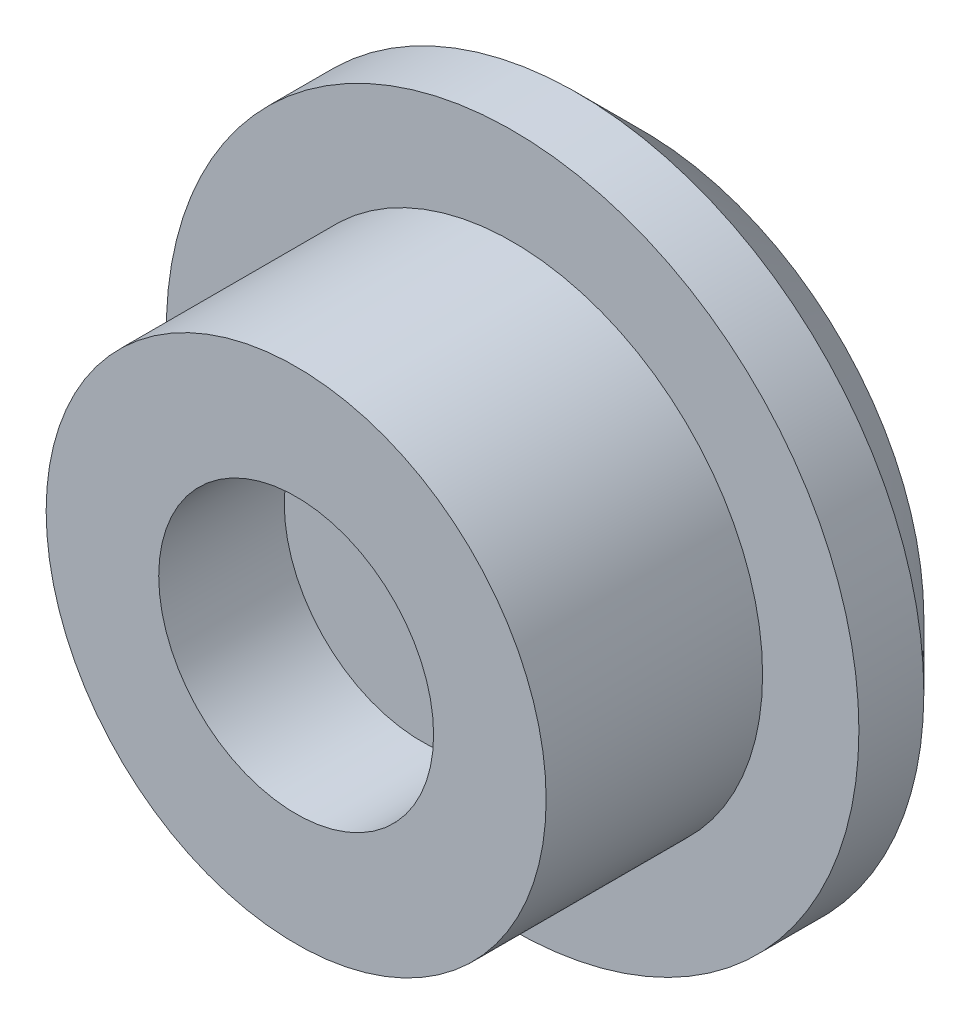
ISO-10303-21;
HEADER;
FILE_DESCRIPTION(('STEP AP214'),'2;1');
FILE_NAME('part.step','',(''),(''),'','','');
FILE_SCHEMA(('AUTOMOTIVE_DESIGN { 1 0 10303 214 1 1 1 1 }'));
ENDSEC;
DATA;
#1=APPLICATION_CONTEXT('core data for automotive mechanical design processes');
#2=APPLICATION_PROTOCOL_DEFINITION('international standard','automotive_design',2000,#1);
#3=PRODUCT_CONTEXT('',#1,'mechanical');
#4=PRODUCT('Part','Part','',(#3));
#5=PRODUCT_RELATED_PRODUCT_CATEGORY('part','',(#4));
#6=PRODUCT_DEFINITION_FORMATION('','',#4);
#7=PRODUCT_DEFINITION_CONTEXT('part definition',#1,'design');
#8=PRODUCT_DEFINITION('design','',#6,#7);
#9=PRODUCT_DEFINITION_SHAPE('','',#8);
#10=(LENGTH_UNIT() NAMED_UNIT(*) SI_UNIT(.MILLI.,.METRE.));
#11=(NAMED_UNIT(*) PLANE_ANGLE_UNIT() SI_UNIT($,.RADIAN.));
#12=(NAMED_UNIT(*) SI_UNIT($,.STERADIAN.) SOLID_ANGLE_UNIT());
#13=UNCERTAINTY_MEASURE_WITH_UNIT(LENGTH_MEASURE(1.E-05),#10,'distance_accuracy_value','');
#14=(GEOMETRIC_REPRESENTATION_CONTEXT(3) GLOBAL_UNCERTAINTY_ASSIGNED_CONTEXT((#13)) GLOBAL_UNIT_ASSIGNED_CONTEXT((#10,
#11,#12)) REPRESENTATION_CONTEXT('',''));
#15=CARTESIAN_POINT('',(0.,0.,0.));
#16=DIRECTION('',(0.,0.,1.));
#17=DIRECTION('',(1.,0.,0.));
#18=AXIS2_PLACEMENT_3D('',#15,#16,#17);
#19=CARTESIAN_POINT('',(0.,0.,5.));
#20=DIRECTION('',(0.,0.,-1.));
#21=DIRECTION('',(-1.,0.,0.));
#22=AXIS2_PLACEMENT_3D('',#19,#20,#21);
#23=CYLINDRICAL_SURFACE('',#22,5.775);
#24=CARTESIAN_POINT('',(0.,0.,5.));
#25=DIRECTION('',(0.,0.,1.));
#26=DIRECTION('',(1.,0.,0.));
#27=AXIS2_PLACEMENT_3D('',#24,#25,#26);
#28=CIRCLE('',#27,5.775);
#29=CARTESIAN_POINT('',(5.775,0.,5.));
#30=VERTEX_POINT('',#29);
#31=EDGE_CURVE('E45',#30,#30,#28,.T.);
#32=ORIENTED_EDGE('',*,*,#31,.F.);
#33=EDGE_LOOP('',(#32));
#34=FACE_BOUND('',#33,.T.);
#35=CARTESIAN_POINT('',(0.,0.,0.));
#36=DIRECTION('',(0.,0.,1.));
#37=DIRECTION('',(1.,0.,0.));
#38=AXIS2_PLACEMENT_3D('',#35,#36,#37);
#39=CIRCLE('',#38,5.775);
#40=CARTESIAN_POINT('',(5.775,0.,0.));
#41=VERTEX_POINT('',#40);
#42=EDGE_CURVE('E49',#41,#41,#39,.T.);
#43=ORIENTED_EDGE('',*,*,#42,.T.);
#44=EDGE_LOOP('',(#43));
#45=FACE_BOUND('',#44,.T.);
#46=ADVANCED_FACE('F33',(#34,#45),#23,.T.);
#47=CARTESIAN_POINT('',(0.,0.,5.));
#48=DIRECTION('',(0.,0.,1.));
#49=DIRECTION('',(1.,0.,0.));
#50=AXIS2_PLACEMENT_3D('',#47,#48,#49);
#51=PLANE('',#50);
#52=CARTESIAN_POINT('',(0.,0.,5.));
#53=DIRECTION('',(0.,0.,1.));
#54=DIRECTION('',(1.,0.,0.));
#55=AXIS2_PLACEMENT_3D('',#52,#53,#54);
#56=CIRCLE('',#55,3.175);
#57=CARTESIAN_POINT('',(3.175,0.,5.));
#58=VERTEX_POINT('',#57);
#59=EDGE_CURVE('E58',#58,#58,#56,.T.);
#60=ORIENTED_EDGE('',*,*,#59,.F.);
#61=EDGE_LOOP('',(#60));
#62=FACE_BOUND('',#61,.T.);
#63=ORIENTED_EDGE('',*,*,#31,.T.);
#64=EDGE_LOOP('',(#63));
#65=FACE_BOUND('',#64,.T.);
#66=ADVANCED_FACE('F73',(#62,#65),#51,.T.);
#67=CARTESIAN_POINT('',(0.,0.,-3.));
#68=DIRECTION('',(0.,0.,1.));
#69=DIRECTION('',(1.,0.,0.));
#70=AXIS2_PLACEMENT_3D('',#67,#68,#69);
#71=CYLINDRICAL_SURFACE('',#70,8.);
#72=CARTESIAN_POINT('',(0.,0.,-1.5));
#73=DIRECTION('',(0.,0.,1.));
#74=DIRECTION('',(1.,0.,0.));
#75=AXIS2_PLACEMENT_3D('',#72,#73,#74);
#76=CIRCLE('',#75,8.);
#77=CARTESIAN_POINT('',(8.,0.,-1.5));
#78=VERTEX_POINT('',#77);
#79=EDGE_CURVE('E41',#78,#78,#76,.T.);
#80=ORIENTED_EDGE('',*,*,#79,.T.);
#81=EDGE_LOOP('',(#80));
#82=FACE_BOUND('',#81,.T.);
#83=CARTESIAN_POINT('',(0.,0.,0.));
#84=DIRECTION('',(0.,0.,1.));
#85=DIRECTION('',(1.,0.,0.));
#86=AXIS2_PLACEMENT_3D('',#83,#84,#85);
#87=CIRCLE('',#86,8.);
#88=CARTESIAN_POINT('',(8.,0.,0.));
#89=VERTEX_POINT('',#88);
#90=EDGE_CURVE('E53',#89,#89,#87,.T.);
#91=ORIENTED_EDGE('',*,*,#90,.F.);
#92=EDGE_LOOP('',(#91));
#93=FACE_BOUND('',#92,.T.);
#94=ADVANCED_FACE('F76',(#82,#93),#71,.T.);
#95=CARTESIAN_POINT('',(0.,0.,-3.));
#96=DIRECTION('',(0.,0.,1.));
#97=DIRECTION('',(1.,0.,0.));
#98=AXIS2_PLACEMENT_3D('',#95,#96,#97);
#99=PLANE('',#98);
#100=CARTESIAN_POINT('',(0.,0.,-3.));
#101=DIRECTION('',(0.,0.,1.));
#102=DIRECTION('',(1.,0.,0.));
#103=AXIS2_PLACEMENT_3D('',#100,#101,#102);
#104=CIRCLE('',#103,6.5);
#105=CARTESIAN_POINT('',(6.5,0.,-3.));
#106=VERTEX_POINT('',#105);
#107=EDGE_CURVE('E10',#106,#106,#104,.F.);
#108=ORIENTED_EDGE('',*,*,#107,.T.);
#109=EDGE_LOOP('',(#108));
#110=FACE_BOUND('',#109,.T.);
#111=ADVANCED_FACE('F86',(#110),#99,.F.);
#112=CARTESIAN_POINT('',(0.,0.,0.));
#113=DIRECTION('',(0.,0.,1.));
#114=DIRECTION('',(1.,0.,0.));
#115=AXIS2_PLACEMENT_3D('',#112,#113,#114);
#116=PLANE('',#115);
#117=ORIENTED_EDGE('',*,*,#42,.F.);
#118=EDGE_LOOP('',(#117));
#119=FACE_BOUND('',#118,.T.);
#120=ORIENTED_EDGE('',*,*,#90,.T.);
#121=EDGE_LOOP('',(#120));
#122=FACE_BOUND('',#121,.T.);
#123=ADVANCED_FACE('F69',(#119,#122),#116,.T.);
#124=CARTESIAN_POINT('',(0.,0.,2.1));
#125=DIRECTION('',(0.,0.,1.));
#126=DIRECTION('',(1.,0.,0.));
#127=AXIS2_PLACEMENT_3D('',#124,#125,#126);
#128=CYLINDRICAL_SURFACE('',#127,3.175);
#129=CARTESIAN_POINT('',(0.,0.,2.1));
#130=DIRECTION('',(0.,0.,1.));
#131=DIRECTION('',(1.,0.,0.));
#132=AXIS2_PLACEMENT_3D('',#129,#130,#131);
#133=CIRCLE('',#132,3.175);
#134=CARTESIAN_POINT('',(3.175,0.,2.1));
#135=VERTEX_POINT('',#134);
#136=EDGE_CURVE('E57',#135,#135,#133,.T.);
#137=ORIENTED_EDGE('',*,*,#136,.F.);
#138=EDGE_LOOP('',(#137));
#139=FACE_BOUND('',#138,.T.);
#140=ORIENTED_EDGE('',*,*,#59,.T.);
#141=EDGE_LOOP('',(#140));
#142=FACE_BOUND('',#141,.T.);
#143=ADVANCED_FACE('F66',(#139,#142),#128,.F.);
#144=CARTESIAN_POINT('',(0.,0.,2.1));
#145=DIRECTION('',(0.,0.,1.));
#146=DIRECTION('',(1.,0.,0.));
#147=AXIS2_PLACEMENT_3D('',#144,#145,#146);
#148=PLANE('',#147);
#149=ORIENTED_EDGE('',*,*,#136,.T.);
#150=EDGE_LOOP('',(#149));
#151=FACE_BOUND('',#150,.T.);
#152=ADVANCED_FACE('F64',(#151),#148,.T.);
#153=CARTESIAN_POINT('',(0.,0.,-1.5));
#154=DIRECTION('',(0.,0.,1.));
#155=DIRECTION('',(1.,0.,0.));
#156=AXIS2_PLACEMENT_3D('',#153,#154,#155);
#157=CONICAL_SURFACE('',#156,8.,0.78539816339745);
#158=CARTESIAN_POINT('',(6.5,0.,-3.));
#159=CARTESIAN_POINT('',(6.515625,0.,-2.984375));
#160=CARTESIAN_POINT('',(6.53125,0.,-2.96875));
#161=CARTESIAN_POINT('',(6.5625,0.,-2.9375));
#162=CARTESIAN_POINT('',(6.578125,0.,-2.921875));
#163=CARTESIAN_POINT('',(6.609375,0.,-2.890625));
#164=CARTESIAN_POINT('',(6.625,0.,-2.875));
#165=CARTESIAN_POINT('',(6.65625,0.,-2.84375));
#166=CARTESIAN_POINT('',(6.671875,0.,-2.828125));
#167=CARTESIAN_POINT('',(6.703125,0.,-2.796875));
#168=CARTESIAN_POINT('',(6.71875,0.,-2.78125));
#169=CARTESIAN_POINT('',(6.75,0.,-2.75));
#170=CARTESIAN_POINT('',(6.765625,0.,-2.734375));
#171=CARTESIAN_POINT('',(6.796875,0.,-2.703125));
#172=CARTESIAN_POINT('',(6.8125,0.,-2.6875));
#173=CARTESIAN_POINT('',(6.84375,0.,-2.65625));
#174=CARTESIAN_POINT('',(6.859375,0.,-2.640625));
#175=CARTESIAN_POINT('',(6.890625,0.,-2.609375));
#176=CARTESIAN_POINT('',(6.90625,0.,-2.59375));
#177=CARTESIAN_POINT('',(6.9375,0.,-2.5625));
#178=CARTESIAN_POINT('',(6.953125,0.,-2.546875));
#179=CARTESIAN_POINT('',(6.984375,0.,-2.515625));
#180=CARTESIAN_POINT('',(7.,0.,-2.5));
#181=CARTESIAN_POINT('',(7.03125,0.,-2.46875));
#182=CARTESIAN_POINT('',(7.046875,0.,-2.453125));
#183=CARTESIAN_POINT('',(7.078125,0.,-2.421875));
#184=CARTESIAN_POINT('',(7.09375,0.,-2.40625));
#185=CARTESIAN_POINT('',(7.125,0.,-2.375));
#186=CARTESIAN_POINT('',(7.140625,0.,-2.359375));
#187=CARTESIAN_POINT('',(7.171875,0.,-2.328125));
#188=CARTESIAN_POINT('',(7.1875,0.,-2.3125));
#189=CARTESIAN_POINT('',(7.21875,0.,-2.28125));
#190=CARTESIAN_POINT('',(7.234375,0.,-2.265625));
#191=CARTESIAN_POINT('',(7.265625,0.,-2.234375));
#192=CARTESIAN_POINT('',(7.28125,0.,-2.21875));
#193=CARTESIAN_POINT('',(7.3125,0.,-2.1875));
#194=CARTESIAN_POINT('',(7.328125,0.,-2.171875));
#195=CARTESIAN_POINT('',(7.359375,0.,-2.140625));
#196=CARTESIAN_POINT('',(7.375,0.,-2.125));
#197=CARTESIAN_POINT('',(7.40625,0.,-2.09375));
#198=CARTESIAN_POINT('',(7.421875,0.,-2.078125));
#199=CARTESIAN_POINT('',(7.453125,0.,-2.046875));
#200=CARTESIAN_POINT('',(7.46875,0.,-2.03125));
#201=CARTESIAN_POINT('',(7.5,0.,-2.));
#202=CARTESIAN_POINT('',(7.515625,0.,-1.984375));
#203=CARTESIAN_POINT('',(7.546875,0.,-1.953125));
#204=CARTESIAN_POINT('',(7.5625,0.,-1.9375));
#205=CARTESIAN_POINT('',(7.59375,0.,-1.90625));
#206=CARTESIAN_POINT('',(7.609375,0.,-1.890625));
#207=CARTESIAN_POINT('',(7.640625,0.,-1.859375));
#208=CARTESIAN_POINT('',(7.65625,0.,-1.84375));
#209=CARTESIAN_POINT('',(7.6875,0.,-1.8125));
#210=CARTESIAN_POINT('',(7.703125,0.,-1.796875));
#211=CARTESIAN_POINT('',(7.734375,0.,-1.765625));
#212=CARTESIAN_POINT('',(7.75,0.,-1.75));
#213=CARTESIAN_POINT('',(7.78125,0.,-1.71875));
#214=CARTESIAN_POINT('',(7.796875,0.,-1.703125));
#215=CARTESIAN_POINT('',(7.828125,0.,-1.671875));
#216=CARTESIAN_POINT('',(7.84375,0.,-1.65625));
#217=CARTESIAN_POINT('',(7.875,0.,-1.625));
#218=CARTESIAN_POINT('',(7.890625,0.,-1.609375));
#219=CARTESIAN_POINT('',(7.921875,0.,-1.578125));
#220=CARTESIAN_POINT('',(7.9375,0.,-1.5625));
#221=CARTESIAN_POINT('',(7.96875,0.,-1.53125));
#222=CARTESIAN_POINT('',(7.984375,0.,-1.515625));
#223=CARTESIAN_POINT('',(8.,0.,-1.5));
#224=B_SPLINE_CURVE_WITH_KNOTS('',3,(#158,#159,#160,#161,#162,#163,#164,#165,#166,#167,#168,
#169,#170,#171,#172,#173,#174,#175,#176,#177,#178,#179,#180,#181,#182,#183,#184,#185,#186,#187,
#188,#189,#190,#191,#192,#193,#194,#195,#196,#197,#198,#199,#200,#201,#202,#203,#204,#205,#206,
#207,#208,#209,#210,#211,#212,#213,#214,#215,#216,#217,#218,#219,#220,#221,#222,#223),
.UNSPECIFIED.,.F.,.F.,(4,2,2,2,2,2,2,2,2,2,2,2,2,2,2,2,2,2,2,2,2,2,2,2,2,2,2,2,2,2,2,2,4),(0.,
0.0662912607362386,0.132582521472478,0.198873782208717,0.265165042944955,0.331456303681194,
0.397747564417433,0.464038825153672,0.53033008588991,0.596621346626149,0.662912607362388,
0.729203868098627,0.795495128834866,0.861786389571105,0.928077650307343,0.994368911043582,
1.06066017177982,1.12695143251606,1.1932426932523,1.25953395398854,1.32582521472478,
1.39211647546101,1.45840773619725,1.52469899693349,1.59099025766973,1.65728151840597,
1.72357277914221,1.78986403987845,1.85615530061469,1.92244656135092,1.98873782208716,
2.0550290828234,2.12132034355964),.UNSPECIFIED.);
#225=EDGE_CURVE('BSEAM36',#106,#78,#224,.T.);
#226=ORIENTED_EDGE('',*,*,#107,.F.);
#227=ORIENTED_EDGE('',*,*,#79,.F.);
#228=ORIENTED_EDGE('',*,*,#225,.T.);
#229=ORIENTED_EDGE('',*,*,#225,.F.);
#230=EDGE_LOOP('',(#226,#228,#227,#229));
#231=FACE_BOUND('',#230,.T.);
#232=ADVANCED_FACE('F36',(#231),#157,.T.);
#233=CLOSED_SHELL('',(#46,#66,#94,#111,#123,#143,#152,#232));
#234=MANIFOLD_SOLID_BREP('B2',#233);
#235=ADVANCED_BREP_SHAPE_REPRESENTATION('',(#18,#234),#14);
#236=SHAPE_DEFINITION_REPRESENTATION(#9,#235);
ENDSEC;
END-ISO-10303-21;
